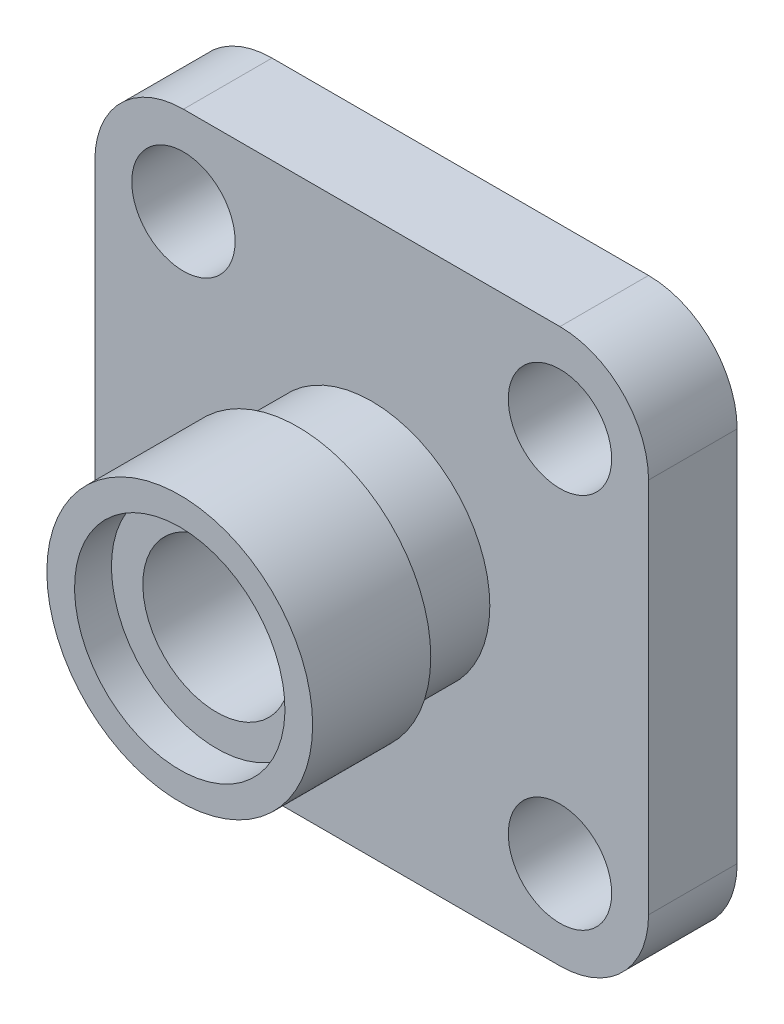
from build123d import *

# Parameters (mm, degrees)
SKETCH_1_R      = 7
EXTRUDE_1_DEPTH = 12
EXTRUDE_START   = -16
SKETCH_8_R      = 18
SKETCH_8_R_2    = 16
EXTRUDE_2_DEPTH = 16


with BuildPart() as part:
    # Sketch 1 → Extrude 1 (new body)
    with BuildSketch(Plane.XY):
        with BuildLine():
            Line((25.5, -37.5), (-25.5, -37.5))
            ThreePointArc((-25.5, -37.5), (-33.985281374, -33.985281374), (-37.5, -25.5))
            Line((-37.5, -25.5), (-37.5, 25.5))
            ThreePointArc((-37.5, 25.5), (-33.985281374, 33.985281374), (-25.5, 37.5))
            Line((-25.5, 37.5), (25.5, 37.5))
            ThreePointArc((25.5, 37.5), (33.985281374, 33.985281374), (37.5, 25.5))
            Line((37.5, 25.5), (37.5, -25.5))
            ThreePointArc((37.5, -25.5), (33.985281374, -33.985281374), (25.5, -37.5))
        make_face()
        with Locations((-25.5, 25.5)):
            Circle(SKETCH_1_R, mode=Mode.SUBTRACT)
        with Locations((25.5, 25.5)):
            Circle(SKETCH_1_R, mode=Mode.SUBTRACT)
        with Locations((25.5, -25.5)):
            Circle(SKETCH_1_R, mode=Mode.SUBTRACT)
        with Locations((-25.5, -25.5)):
            Circle(SKETCH_1_R, mode=Mode.SUBTRACT)
    extrude(amount=EXTRUDE_1_DEPTH)

    # Sketch 2 → Revolve 1 (revolve)
    with BuildSketch(Plane(origin=(0, 0, 0), x_dir=(0, 0, -1), z_dir=(1, 0, 0)), mode=Mode.PRIVATE) as revolve_1_sk:
        Polygon((0, 26.5), (1, 26.5), (1, 25), (6, 25), (6, 20.5), (10, 20.5), (10, 0), (-38, 0), (-38, 16), (-12, 16), align=None)
    revolve(revolve_1_sk.sketch.rotate(Axis((0, 0, 48.421885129), (0, 0, -1)), 90), axis=Axis((0, 0, 48.421885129), (0, 0, -1)))

    # Sketch 3 → Cut-Revolve 1 (revolve, cut)
    with BuildSketch(Plane(origin=(0, 0, 0), x_dir=(0, 0, -1), z_dir=(1, 0, 0))):
        Polygon((-38, 14.25), (-33, 14.25), (-33, 10), (3, 10), (3, 17.5), (10, 17.5), (10, 0), (-38, 0), align=None)
    revolve(axis=Axis((0, 0, -10), (0, 0, 1)), mode=Mode.SUBTRACT)

    # Sketch 8 → Extrude 2 (add)
    with BuildSketch(Plane.XY.offset(38).offset(EXTRUDE_START)):
        Circle(SKETCH_8_R)
        Circle(SKETCH_8_R_2, mode=Mode.SUBTRACT)
    extrude(amount=EXTRUDE_2_DEPTH)


solid = part.part
